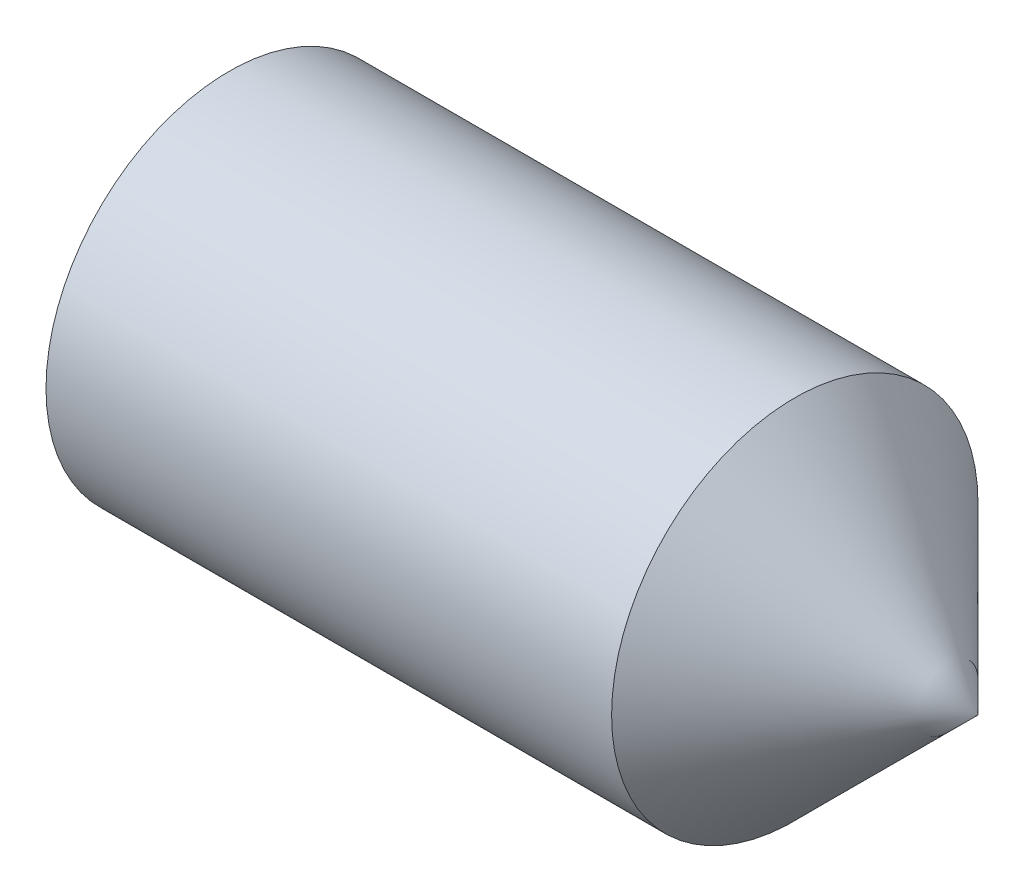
ISO-10303-21;
HEADER;
FILE_DESCRIPTION(('STEP AP214'),'2;1');
FILE_NAME('part.step','',(''),(''),'','','');
FILE_SCHEMA(('AUTOMOTIVE_DESIGN { 1 0 10303 214 1 1 1 1 }'));
ENDSEC;
DATA;
#1=APPLICATION_CONTEXT('core data for automotive mechanical design processes');
#2=APPLICATION_PROTOCOL_DEFINITION('international standard','automotive_design',2000,#1);
#3=PRODUCT_CONTEXT('',#1,'mechanical');
#4=PRODUCT('Part','Part','',(#3));
#5=PRODUCT_RELATED_PRODUCT_CATEGORY('part','',(#4));
#6=PRODUCT_DEFINITION_FORMATION('','',#4);
#7=PRODUCT_DEFINITION_CONTEXT('part definition',#1,'design');
#8=PRODUCT_DEFINITION('design','',#6,#7);
#9=PRODUCT_DEFINITION_SHAPE('','',#8);
#10=(LENGTH_UNIT() NAMED_UNIT(*) SI_UNIT(.MILLI.,.METRE.));
#11=(NAMED_UNIT(*) PLANE_ANGLE_UNIT() SI_UNIT($,.RADIAN.));
#12=(NAMED_UNIT(*) SI_UNIT($,.STERADIAN.) SOLID_ANGLE_UNIT());
#13=UNCERTAINTY_MEASURE_WITH_UNIT(LENGTH_MEASURE(1.E-05),#10,'distance_accuracy_value','');
#14=(GEOMETRIC_REPRESENTATION_CONTEXT(3) GLOBAL_UNCERTAINTY_ASSIGNED_CONTEXT((#13)) GLOBAL_UNIT_ASSIGNED_CONTEXT((#10,
#11,#12)) REPRESENTATION_CONTEXT('',''));
#15=CARTESIAN_POINT('',(0.,0.,0.));
#16=DIRECTION('',(0.,0.,1.));
#17=DIRECTION('',(1.,0.,0.));
#18=AXIS2_PLACEMENT_3D('',#15,#16,#17);
#19=CARTESIAN_POINT('',(0.,0.,0.));
#20=DIRECTION('',(-1.,0.,0.));
#21=DIRECTION('',(0.,0.,1.));
#22=AXIS2_PLACEMENT_3D('',#19,#20,#21);
#23=PLANE('',#22);
#24=CARTESIAN_POINT('',(0.,0.,0.));
#25=DIRECTION('',(-1.,0.,0.));
#26=DIRECTION('',(0.,0.,1.));
#27=AXIS2_PLACEMENT_3D('',#24,#25,#26);
#28=CIRCLE('',#27,10.352);
#29=CARTESIAN_POINT('',(0.,0.,10.352));
#30=VERTEX_POINT('',#29);
#31=EDGE_CURVE('E11',#30,#30,#28,.T.);
#32=ORIENTED_EDGE('',*,*,#31,.T.);
#33=EDGE_LOOP('',(#32));
#34=FACE_BOUND('',#33,.T.);
#35=DIRECTION('',(0.,0.,-1.));
#36=VECTOR('',#35,1.);
#37=CARTESIAN_POINT('',(0.,6.,3.46410161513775));
#38=LINE('',#37,#36);
#39=CARTESIAN_POINT('',(0.,6.,3.46410161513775));
#40=VERTEX_POINT('',#39);
#41=CARTESIAN_POINT('',(0.,6.,-3.46410161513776));
#42=VERTEX_POINT('',#41);
#43=EDGE_CURVE('E96',#40,#42,#38,.T.);
#44=ORIENTED_EDGE('',*,*,#43,.F.);
#45=DIRECTION('',(0.,-0.866025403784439,0.5));
#46=VECTOR('',#45,1.);
#47=CARTESIAN_POINT('',(0.,6.,3.46410161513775));
#48=LINE('',#47,#46);
#49=CARTESIAN_POINT('',(0.,0.,6.9282032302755));
#50=VERTEX_POINT('',#49);
#51=EDGE_CURVE('E49',#40,#50,#48,.T.);
#52=ORIENTED_EDGE('',*,*,#51,.T.);
#53=DIRECTION('',(0.,0.866025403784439,0.5));
#54=VECTOR('',#53,1.);
#55=CARTESIAN_POINT('',(0.,-5.99999999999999,3.46410161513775));
#56=LINE('',#55,#54);
#57=CARTESIAN_POINT('',(0.,-5.99999999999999,3.46410161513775));
#58=VERTEX_POINT('',#57);
#59=EDGE_CURVE('E102',#58,#50,#56,.T.);
#60=ORIENTED_EDGE('',*,*,#59,.F.);
#61=DIRECTION('',(0.,0.,-1.));
#62=VECTOR('',#61,1.);
#63=CARTESIAN_POINT('',(0.,-5.99999999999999,3.46410161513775));
#64=LINE('',#63,#62);
#65=CARTESIAN_POINT('',(0.,-5.99999999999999,-3.46410161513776));
#66=VERTEX_POINT('',#65);
#67=EDGE_CURVE('E122',#58,#66,#64,.T.);
#68=ORIENTED_EDGE('',*,*,#67,.T.);
#69=DIRECTION('',(0.,0.866025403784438,-0.5));
#70=VECTOR('',#69,1.);
#71=CARTESIAN_POINT('',(0.,-5.99999999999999,-3.46410161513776));
#72=LINE('',#71,#70);
#73=CARTESIAN_POINT('',(0.,0.,-6.92820323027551));
#74=VERTEX_POINT('',#73);
#75=EDGE_CURVE('E125',#66,#74,#72,.T.);
#76=ORIENTED_EDGE('',*,*,#75,.T.);
#77=DIRECTION('',(0.,-0.866025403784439,-0.5));
#78=VECTOR('',#77,1.);
#79=CARTESIAN_POINT('',(0.,6.,-3.46410161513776));
#80=LINE('',#79,#78);
#81=EDGE_CURVE('E128',#42,#74,#80,.T.);
#82=ORIENTED_EDGE('',*,*,#81,.F.);
#83=EDGE_LOOP('',(#44,#52,#60,#68,#76,#82));
#84=FACE_BOUND('',#83,.T.);
#85=ADVANCED_FACE('F35',(#34,#84),#23,.T.);
#86=CARTESIAN_POINT('',(0.,0.,0.));
#87=DIRECTION('',(1.,0.,0.));
#88=DIRECTION('',(0.,0.,-1.));
#89=AXIS2_PLACEMENT_3D('',#86,#87,#88);
#90=CONICAL_SURFACE('',#89,10.352,1.0471975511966);
#91=CARTESIAN_POINT('',(0.951473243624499,0.,0.));
#92=DIRECTION('',(-1.,0.,0.));
#93=DIRECTION('',(0.,0.,1.));
#94=AXIS2_PLACEMENT_3D('',#91,#92,#93);
#95=CIRCLE('',#94,12.);
#96=CARTESIAN_POINT('',(0.951473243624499,0.,12.));
#97=VERTEX_POINT('',#96);
#98=EDGE_CURVE('E42',#97,#97,#95,.T.);
#99=ORIENTED_EDGE('',*,*,#98,.T.);
#100=EDGE_LOOP('',(#99));
#101=FACE_BOUND('',#100,.T.);
#102=ORIENTED_EDGE('',*,*,#31,.F.);
#103=EDGE_LOOP('',(#102));
#104=FACE_BOUND('',#103,.T.);
#105=ADVANCED_FACE('F145',(#101,#104),#90,.T.);
#106=CARTESIAN_POINT('',(-12.7,0.,0.));
#107=DIRECTION('',(-1.,0.,0.));
#108=DIRECTION('',(0.,0.,1.));
#109=AXIS2_PLACEMENT_3D('',#106,#107,#108);
#110=CYLINDRICAL_SURFACE('',#109,12.);
#111=CARTESIAN_POINT('',(38.,0.,0.));
#112=DIRECTION('',(-1.,0.,0.));
#113=DIRECTION('',(0.,0.,1.));
#114=AXIS2_PLACEMENT_3D('',#111,#112,#113);
#115=CIRCLE('',#114,12.);
#116=CARTESIAN_POINT('',(38.,0.,12.));
#117=VERTEX_POINT('',#116);
#118=EDGE_CURVE('E103',#117,#117,#115,.T.);
#119=ORIENTED_EDGE('',*,*,#118,.T.);
#120=EDGE_LOOP('',(#119));
#121=FACE_BOUND('',#120,.T.);
#122=ORIENTED_EDGE('',*,*,#98,.F.);
#123=EDGE_LOOP('',(#122));
#124=FACE_BOUND('',#123,.T.);
#125=ADVANCED_FACE('F148',(#121,#124),#110,.T.);
#126=CARTESIAN_POINT('',(38.,0.,0.));
#127=DIRECTION('',(-1.,0.,0.));
#128=DIRECTION('',(0.,0.,1.));
#129=AXIS2_PLACEMENT_3D('',#126,#127,#128);
#130=CONICAL_SURFACE('',#129,12.,0.78539816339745);
#131=CARTESIAN_POINT('',(50.,0.,0.));
#132=VERTEX_POINT('',#131);
#133=VERTEX_LOOP('',#132);
#134=FACE_BOUND('',#133,.T.);
#135=ORIENTED_EDGE('',*,*,#118,.F.);
#136=EDGE_LOOP('',(#135));
#137=FACE_BOUND('',#136,.T.);
#138=ADVANCED_FACE('F150',(#134,#137),#130,.T.);
#139=CARTESIAN_POINT('',(15.,6.,3.46410161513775));
#140=DIRECTION('',(0.,-0.5,-0.866025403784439));
#141=DIRECTION('',(0.,0.866025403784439,-0.5));
#142=AXIS2_PLACEMENT_3D('',#139,#140,#141);
#143=PLANE('',#142);
#144=ORIENTED_EDGE('',*,*,#51,.F.);
#145=DIRECTION('',(-1.,0.,0.));
#146=VECTOR('',#145,1.);
#147=CARTESIAN_POINT('',(15.,6.,3.46410161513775));
#148=LINE('',#147,#146);
#149=CARTESIAN_POINT('',(15.,6.,3.46410161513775));
#150=VERTEX_POINT('',#149);
#151=EDGE_CURVE('E90',#150,#40,#148,.T.);
#152=ORIENTED_EDGE('',*,*,#151,.F.);
#153=DIRECTION('',(0.,-0.866025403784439,0.5));
#154=VECTOR('',#153,1.);
#155=CARTESIAN_POINT('',(15.,6.,3.46410161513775));
#156=LINE('',#155,#154);
#157=CARTESIAN_POINT('',(15.,0.,6.9282032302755));
#158=VERTEX_POINT('',#157);
#159=EDGE_CURVE('E85',#150,#158,#156,.T.);
#160=ORIENTED_EDGE('',*,*,#159,.T.);
#161=DIRECTION('',(-1.,0.,0.));
#162=VECTOR('',#161,1.);
#163=CARTESIAN_POINT('',(15.,0.,6.9282032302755));
#164=LINE('',#163,#162);
#165=EDGE_CURVE('E88',#158,#50,#164,.T.);
#166=ORIENTED_EDGE('',*,*,#165,.T.);
#167=EDGE_LOOP('',(#144,#152,#160,#166));
#168=FACE_BOUND('',#167,.T.);
#169=ADVANCED_FACE('F87',(#168),#143,.T.);
#170=CARTESIAN_POINT('',(15.,-5.99999999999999,3.46410161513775));
#171=DIRECTION('',(0.,-0.5,0.866025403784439));
#172=DIRECTION('',(0.,-0.866025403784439,-0.5));
#173=AXIS2_PLACEMENT_3D('',#170,#171,#172);
#174=PLANE('',#173);
#175=ORIENTED_EDGE('',*,*,#59,.T.);
#176=ORIENTED_EDGE('',*,*,#165,.F.);
#177=DIRECTION('',(0.,0.866025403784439,0.5));
#178=VECTOR('',#177,1.);
#179=CARTESIAN_POINT('',(15.,-5.99999999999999,3.46410161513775));
#180=LINE('',#179,#178);
#181=CARTESIAN_POINT('',(15.,-5.99999999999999,3.46410161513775));
#182=VERTEX_POINT('',#181);
#183=EDGE_CURVE('E95',#182,#158,#180,.T.);
#184=ORIENTED_EDGE('',*,*,#183,.F.);
#185=DIRECTION('',(-1.,0.,0.));
#186=VECTOR('',#185,1.);
#187=CARTESIAN_POINT('',(15.,-5.99999999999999,3.46410161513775));
#188=LINE('',#187,#186);
#189=EDGE_CURVE('E104',#182,#58,#188,.T.);
#190=ORIENTED_EDGE('',*,*,#189,.T.);
#191=EDGE_LOOP('',(#175,#176,#184,#190));
#192=FACE_BOUND('',#191,.T.);
#193=ADVANCED_FACE('F100',(#192),#174,.F.);
#194=CARTESIAN_POINT('',(15.,-5.99999999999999,3.46410161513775));
#195=DIRECTION('',(0.,1.,0.));
#196=DIRECTION('',(0.,0.,1.));
#197=AXIS2_PLACEMENT_3D('',#194,#195,#196);
#198=PLANE('',#197);
#199=ORIENTED_EDGE('',*,*,#67,.F.);
#200=ORIENTED_EDGE('',*,*,#189,.F.);
#201=DIRECTION('',(0.,0.,-1.));
#202=VECTOR('',#201,1.);
#203=CARTESIAN_POINT('',(15.,-5.99999999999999,3.46410161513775));
#204=LINE('',#203,#202);
#205=CARTESIAN_POINT('',(15.,-5.99999999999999,-3.46410161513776));
#206=VERTEX_POINT('',#205);
#207=EDGE_CURVE('E109',#182,#206,#204,.T.);
#208=ORIENTED_EDGE('',*,*,#207,.T.);
#209=DIRECTION('',(-1.,0.,0.));
#210=VECTOR('',#209,1.);
#211=CARTESIAN_POINT('',(15.,-5.99999999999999,-3.46410161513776));
#212=LINE('',#211,#210);
#213=EDGE_CURVE('E138',#206,#66,#212,.T.);
#214=ORIENTED_EDGE('',*,*,#213,.T.);
#215=EDGE_LOOP('',(#199,#200,#208,#214));
#216=FACE_BOUND('',#215,.T.);
#217=ADVANCED_FACE('F178',(#216),#198,.T.);
#218=CARTESIAN_POINT('',(15.,-5.99999999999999,-3.46410161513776));
#219=DIRECTION('',(0.,0.5,0.866025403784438));
#220=DIRECTION('',(0.,-0.866025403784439,0.5));
#221=AXIS2_PLACEMENT_3D('',#218,#219,#220);
#222=PLANE('',#221);
#223=ORIENTED_EDGE('',*,*,#75,.F.);
#224=ORIENTED_EDGE('',*,*,#213,.F.);
#225=DIRECTION('',(0.,0.866025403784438,-0.5));
#226=VECTOR('',#225,1.);
#227=CARTESIAN_POINT('',(15.,-5.99999999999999,-3.46410161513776));
#228=LINE('',#227,#226);
#229=CARTESIAN_POINT('',(15.,0.,-6.92820323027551));
#230=VERTEX_POINT('',#229);
#231=EDGE_CURVE('E111',#206,#230,#228,.T.);
#232=ORIENTED_EDGE('',*,*,#231,.T.);
#233=DIRECTION('',(-1.,0.,0.));
#234=VECTOR('',#233,1.);
#235=CARTESIAN_POINT('',(15.,0.,-6.92820323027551));
#236=LINE('',#235,#234);
#237=EDGE_CURVE('E136',#230,#74,#236,.T.);
#238=ORIENTED_EDGE('',*,*,#237,.T.);
#239=EDGE_LOOP('',(#223,#224,#232,#238));
#240=FACE_BOUND('',#239,.T.);
#241=ADVANCED_FACE('F174',(#240),#222,.T.);
#242=CARTESIAN_POINT('',(15.,6.,-3.46410161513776));
#243=DIRECTION('',(0.,0.5,-0.866025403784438));
#244=DIRECTION('',(0.,0.866025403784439,0.5));
#245=AXIS2_PLACEMENT_3D('',#242,#243,#244);
#246=PLANE('',#245);
#247=ORIENTED_EDGE('',*,*,#81,.T.);
#248=ORIENTED_EDGE('',*,*,#237,.F.);
#249=DIRECTION('',(0.,-0.866025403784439,-0.5));
#250=VECTOR('',#249,1.);
#251=CARTESIAN_POINT('',(15.,6.,-3.46410161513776));
#252=LINE('',#251,#250);
#253=CARTESIAN_POINT('',(15.,6.,-3.46410161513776));
#254=VERTEX_POINT('',#253);
#255=EDGE_CURVE('E115',#254,#230,#252,.T.);
#256=ORIENTED_EDGE('',*,*,#255,.F.);
#257=DIRECTION('',(-1.,0.,0.));
#258=VECTOR('',#257,1.);
#259=CARTESIAN_POINT('',(15.,6.,-3.46410161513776));
#260=LINE('',#259,#258);
#261=EDGE_CURVE('E134',#254,#42,#260,.T.);
#262=ORIENTED_EDGE('',*,*,#261,.T.);
#263=EDGE_LOOP('',(#247,#248,#256,#262));
#264=FACE_BOUND('',#263,.T.);
#265=ADVANCED_FACE('F171',(#264),#246,.F.);
#266=CARTESIAN_POINT('',(15.,6.,3.46410161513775));
#267=DIRECTION('',(0.,1.,0.));
#268=DIRECTION('',(0.,0.,1.));
#269=AXIS2_PLACEMENT_3D('',#266,#267,#268);
#270=PLANE('',#269);
#271=ORIENTED_EDGE('',*,*,#43,.T.);
#272=ORIENTED_EDGE('',*,*,#261,.F.);
#273=DIRECTION('',(0.,0.,-1.));
#274=VECTOR('',#273,1.);
#275=CARTESIAN_POINT('',(15.,6.,3.46410161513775));
#276=LINE('',#275,#274);
#277=EDGE_CURVE('E118',#150,#254,#276,.T.);
#278=ORIENTED_EDGE('',*,*,#277,.F.);
#279=ORIENTED_EDGE('',*,*,#151,.T.);
#280=EDGE_LOOP('',(#271,#272,#278,#279));
#281=FACE_BOUND('',#280,.T.);
#282=ADVANCED_FACE('F167',(#281),#270,.F.);
#283=CARTESIAN_POINT('',(15.,6.,3.46410161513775));
#284=DIRECTION('',(1.,0.,0.));
#285=DIRECTION('',(0.,0.,-1.));
#286=AXIS2_PLACEMENT_3D('',#283,#284,#285);
#287=PLANE('',#286);
#288=ORIENTED_EDGE('',*,*,#159,.F.);
#289=ORIENTED_EDGE('',*,*,#277,.T.);
#290=ORIENTED_EDGE('',*,*,#255,.T.);
#291=ORIENTED_EDGE('',*,*,#231,.F.);
#292=ORIENTED_EDGE('',*,*,#207,.F.);
#293=ORIENTED_EDGE('',*,*,#183,.T.);
#294=EDGE_LOOP('',(#288,#289,#290,#291,#292,#293));
#295=FACE_BOUND('',#294,.T.);
#296=ADVANCED_FACE('F107',(#295),#287,.F.);
#297=CLOSED_SHELL('',(#85,#105,#125,#138,#169,#193,#217,#241,#265,#282,#296));
#298=MANIFOLD_SOLID_BREP('B2',#297);
#299=ADVANCED_BREP_SHAPE_REPRESENTATION('',(#18,#298),#14);
#300=SHAPE_DEFINITION_REPRESENTATION(#9,#299);
ENDSEC;
END-ISO-10303-21;
